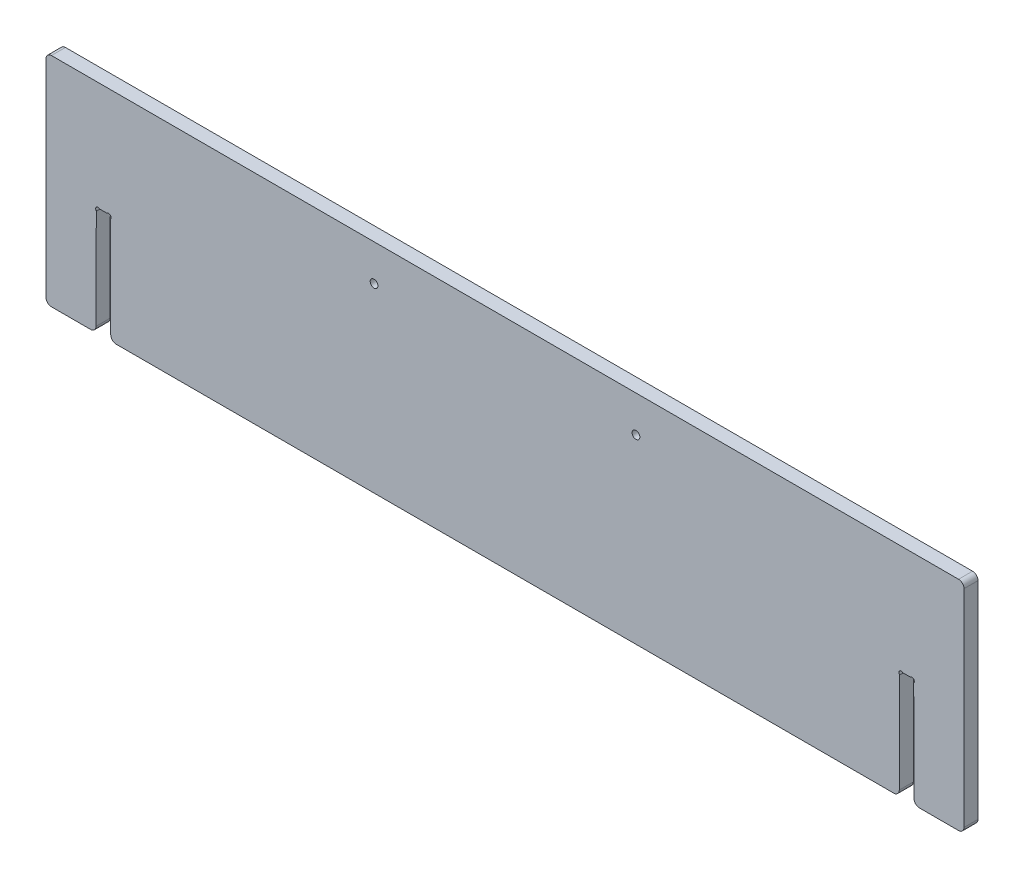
ISO-10303-21;
HEADER;
FILE_DESCRIPTION(('STEP AP214'),'2;1');
FILE_NAME('part.step','',(''),(''),'','','');
FILE_SCHEMA(('AUTOMOTIVE_DESIGN { 1 0 10303 214 1 1 1 1 }'));
ENDSEC;
DATA;
#1=APPLICATION_CONTEXT('core data for automotive mechanical design processes');
#2=APPLICATION_PROTOCOL_DEFINITION('international standard','automotive_design',2000,#1);
#3=PRODUCT_CONTEXT('',#1,'mechanical');
#4=PRODUCT('Part','Part','',(#3));
#5=PRODUCT_RELATED_PRODUCT_CATEGORY('part','',(#4));
#6=PRODUCT_DEFINITION_FORMATION('','',#4);
#7=PRODUCT_DEFINITION_CONTEXT('part definition',#1,'design');
#8=PRODUCT_DEFINITION('design','',#6,#7);
#9=PRODUCT_DEFINITION_SHAPE('','',#8);
#10=(LENGTH_UNIT() NAMED_UNIT(*) SI_UNIT(.MILLI.,.METRE.));
#11=(NAMED_UNIT(*) PLANE_ANGLE_UNIT() SI_UNIT($,.RADIAN.));
#12=(NAMED_UNIT(*) SI_UNIT($,.STERADIAN.) SOLID_ANGLE_UNIT());
#13=UNCERTAINTY_MEASURE_WITH_UNIT(LENGTH_MEASURE(1.E-05),#10,'distance_accuracy_value','');
#14=(GEOMETRIC_REPRESENTATION_CONTEXT(3) GLOBAL_UNCERTAINTY_ASSIGNED_CONTEXT((#13)) GLOBAL_UNIT_ASSIGNED_CONTEXT((#10,
#11,#12)) REPRESENTATION_CONTEXT('',''));
#15=CARTESIAN_POINT('',(0.,0.,0.));
#16=DIRECTION('',(0.,0.,1.));
#17=DIRECTION('',(1.,0.,0.));
#18=AXIS2_PLACEMENT_3D('',#15,#16,#17);
#19=CARTESIAN_POINT('',(0.,0.,18.));
#20=DIRECTION('',(0.,1.,0.));
#21=DIRECTION('',(0.,0.,1.));
#22=AXIS2_PLACEMENT_3D('',#19,#20,#21);
#23=PLANE('',#22);
#24=DIRECTION('',(1.,0.,0.));
#25=VECTOR('',#24,1.);
#26=CARTESIAN_POINT('',(0.,0.,0.));
#27=LINE('',#26,#25);
#28=CARTESIAN_POINT('',(7.,0.,0.));
#29=VERTEX_POINT('',#28);
#30=CARTESIAN_POINT('',(57.3324714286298,0.,0.));
#31=VERTEX_POINT('',#30);
#32=EDGE_CURVE('E466',#29,#31,#27,.T.);
#33=ORIENTED_EDGE('',*,*,#32,.T.);
#34=DIRECTION('',(0.,0.,1.));
#35=VECTOR('',#34,1.);
#36=CARTESIAN_POINT('',(57.3324714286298,0.,18.));
#37=LINE('',#36,#35);
#38=CARTESIAN_POINT('',(57.3324714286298,0.,18.));
#39=VERTEX_POINT('',#38);
#40=EDGE_CURVE('E491',#31,#39,#37,.T.);
#41=ORIENTED_EDGE('',*,*,#40,.T.);
#42=DIRECTION('',(1.,0.,0.));
#43=VECTOR('',#42,1.);
#44=CARTESIAN_POINT('',(0.,0.,18.));
#45=LINE('',#44,#43);
#46=CARTESIAN_POINT('',(7.,0.,18.));
#47=VERTEX_POINT('',#46);
#48=EDGE_CURVE('E459',#47,#39,#45,.T.);
#49=ORIENTED_EDGE('',*,*,#48,.F.);
#50=DIRECTION('',(0.,0.,-1.));
#51=VECTOR('',#50,1.);
#52=CARTESIAN_POINT('',(7.,0.,18.));
#53=LINE('',#52,#51);
#54=EDGE_CURVE('E488',#47,#29,#53,.T.);
#55=ORIENTED_EDGE('',*,*,#54,.T.);
#56=EDGE_LOOP('',(#33,#41,#49,#55));
#57=FACE_BOUND('',#56,.T.);
#58=ADVANCED_FACE('F33',(#57),#23,.F.);
#59=CARTESIAN_POINT('',(0.,0.,18.));
#60=DIRECTION('',(1.,0.,0.));
#61=DIRECTION('',(0.,0.,-1.));
#62=AXIS2_PLACEMENT_3D('',#59,#60,#61);
#63=PLANE('',#62);
#64=DIRECTION('',(0.,-1.,0.));
#65=VECTOR('',#64,1.);
#66=CARTESIAN_POINT('',(0.,0.,0.));
#67=LINE('',#66,#65);
#68=CARTESIAN_POINT('',(0.,273.,0.));
#69=VERTEX_POINT('',#68);
#70=CARTESIAN_POINT('',(0.,7.,0.));
#71=VERTEX_POINT('',#70);
#72=EDGE_CURVE('E438',#69,#71,#67,.T.);
#73=ORIENTED_EDGE('',*,*,#72,.T.);
#74=DIRECTION('',(0.,0.,-1.));
#75=VECTOR('',#74,1.);
#76=CARTESIAN_POINT('',(0.,7.,18.));
#77=LINE('',#76,#75);
#78=CARTESIAN_POINT('',(0.,7.,18.));
#79=VERTEX_POINT('',#78);
#80=EDGE_CURVE('E41',#71,#79,#77,.F.);
#81=ORIENTED_EDGE('',*,*,#80,.T.);
#82=DIRECTION('',(0.,-1.,0.));
#83=VECTOR('',#82,1.);
#84=CARTESIAN_POINT('',(0.,0.,18.));
#85=LINE('',#84,#83);
#86=CARTESIAN_POINT('',(0.,273.,18.));
#87=VERTEX_POINT('',#86);
#88=EDGE_CURVE('E453',#87,#79,#85,.T.);
#89=ORIENTED_EDGE('',*,*,#88,.F.);
#90=DIRECTION('',(0.,0.,-1.));
#91=VECTOR('',#90,1.);
#92=CARTESIAN_POINT('',(0.,273.,18.));
#93=LINE('',#92,#91);
#94=EDGE_CURVE('E496',#87,#69,#93,.T.);
#95=ORIENTED_EDGE('',*,*,#94,.T.);
#96=EDGE_LOOP('',(#73,#81,#89,#95));
#97=FACE_BOUND('',#96,.T.);
#98=ADVANCED_FACE('F501',(#97),#63,.F.);
#99=CARTESIAN_POINT('',(90.2925285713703,0.,18.));
#100=VERTEX_POINT('',#99);
#101=CARTESIAN_POINT('',(1090.70747142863,0.,18.));
#102=VERTEX_POINT('',#101);
#103=EDGE_CURVE('E456',#100,#102,#45,.T.);
#104=ORIENTED_EDGE('',*,*,#103,.F.);
#105=DIRECTION('',(0.,0.,1.));
#106=VECTOR('',#105,1.);
#107=CARTESIAN_POINT('',(90.2925285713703,0.,18.));
#108=LINE('',#107,#106);
#109=CARTESIAN_POINT('',(90.2925285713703,0.,0.));
#110=VERTEX_POINT('',#109);
#111=EDGE_CURVE('E480',#100,#110,#108,.F.);
#112=ORIENTED_EDGE('',*,*,#111,.T.);
#113=CARTESIAN_POINT('',(1090.70747142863,0.,0.));
#114=VERTEX_POINT('',#113);
#115=EDGE_CURVE('E465',#110,#114,#27,.T.);
#116=ORIENTED_EDGE('',*,*,#115,.T.);
#117=DIRECTION('',(0.,0.,1.));
#118=VECTOR('',#117,1.);
#119=CARTESIAN_POINT('',(1090.70747142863,0.,18.));
#120=LINE('',#119,#118);
#121=EDGE_CURVE('E347',#102,#114,#120,.F.);
#122=ORIENTED_EDGE('',*,*,#121,.F.);
#123=EDGE_LOOP('',(#104,#112,#116,#122));
#124=FACE_BOUND('',#123,.T.);
#125=ADVANCED_FACE('F563',(#124),#23,.F.);
#126=CARTESIAN_POINT('',(0.,280.,18.));
#127=DIRECTION('',(0.,-1.,0.));
#128=DIRECTION('',(0.,0.,-1.));
#129=AXIS2_PLACEMENT_3D('',#126,#127,#128);
#130=PLANE('',#129);
#131=DIRECTION('',(-1.,0.,0.));
#132=VECTOR('',#131,1.);
#133=CARTESIAN_POINT('',(0.,280.,0.));
#134=LINE('',#133,#132);
#135=CARTESIAN_POINT('',(1174.,280.,0.));
#136=VERTEX_POINT('',#135);
#137=CARTESIAN_POINT('',(7.,280.,0.));
#138=VERTEX_POINT('',#137);
#139=EDGE_CURVE('E457',#136,#138,#134,.T.);
#140=ORIENTED_EDGE('',*,*,#139,.T.);
#141=DIRECTION('',(0.,0.,-1.));
#142=VECTOR('',#141,1.);
#143=CARTESIAN_POINT('',(7.,280.,18.));
#144=LINE('',#143,#142);
#145=CARTESIAN_POINT('',(7.,280.,18.));
#146=VERTEX_POINT('',#145);
#147=EDGE_CURVE('E11',#138,#146,#144,.F.);
#148=ORIENTED_EDGE('',*,*,#147,.T.);
#149=DIRECTION('',(-1.,0.,0.));
#150=VECTOR('',#149,1.);
#151=CARTESIAN_POINT('',(0.,280.,18.));
#152=LINE('',#151,#150);
#153=CARTESIAN_POINT('',(1174.,280.,18.));
#154=VERTEX_POINT('',#153);
#155=EDGE_CURVE('E460',#154,#146,#152,.T.);
#156=ORIENTED_EDGE('',*,*,#155,.F.);
#157=DIRECTION('',(0.,0.,-1.));
#158=VECTOR('',#157,1.);
#159=CARTESIAN_POINT('',(1174.,280.,18.));
#160=LINE('',#159,#158);
#161=EDGE_CURVE('E374',#136,#154,#160,.F.);
#162=ORIENTED_EDGE('',*,*,#161,.F.);
#163=EDGE_LOOP('',(#140,#148,#156,#162));
#164=FACE_BOUND('',#163,.T.);
#165=ADVANCED_FACE('F616',(#164),#130,.F.);
#166=CARTESIAN_POINT('',(0.,0.,18.));
#167=DIRECTION('',(0.,0.,-1.));
#168=DIRECTION('',(-1.,0.,0.));
#169=AXIS2_PLACEMENT_3D('',#166,#167,#168);
#170=PLANE('',#169);
#171=CARTESIAN_POINT('',(422.0625,233.333333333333,18.));
#172=DIRECTION('',(0.,0.,1.));
#173=DIRECTION('',(1.,0.,0.));
#174=AXIS2_PLACEMENT_3D('',#171,#172,#173);
#175=CIRCLE('',#174,4.99999999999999);
#176=CARTESIAN_POINT('',(427.0625,233.333333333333,18.));
#177=VERTEX_POINT('',#176);
#178=EDGE_CURVE('E377',#177,#177,#175,.T.);
#179=ORIENTED_EDGE('',*,*,#178,.F.);
#180=EDGE_LOOP('',(#179));
#181=FACE_BOUND('',#180,.T.);
#182=DIRECTION('',(-0.00285713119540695,0.999995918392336,0.));
#183=VECTOR('',#182,1.);
#184=CARTESIAN_POINT('',(82.9260745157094,135.248919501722,18.));
#185=LINE('',#184,#183);
#186=CARTESIAN_POINT('',(83.2925571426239,6.9800000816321,18.));
#187=VERTEX_POINT('',#186);
#188=CARTESIAN_POINT('',(82.9260745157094,135.248919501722,18.));
#189=VERTEX_POINT('',#188);
#190=EDGE_CURVE('E381',#187,#189,#185,.T.);
#191=ORIENTED_EDGE('',*,*,#190,.F.);
#192=CARTESIAN_POINT('',(90.2925285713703,7.00000000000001,18.));
#193=DIRECTION('',(0.,0.,-1.));
#194=DIRECTION('',(-1.,0.,0.));
#195=AXIS2_PLACEMENT_3D('',#192,#193,#194);
#196=CIRCLE('',#195,7.);
#197=EDGE_CURVE('E478',#187,#100,#196,.F.);
#198=ORIENTED_EDGE('',*,*,#197,.T.);
#199=ORIENTED_EDGE('',*,*,#103,.T.);
#200=CARTESIAN_POINT('',(1090.70747142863,7.00000000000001,18.));
#201=DIRECTION('',(0.,0.,1.));
#202=DIRECTION('',(1.,0.,0.));
#203=AXIS2_PLACEMENT_3D('',#200,#201,#202);
#204=CIRCLE('',#203,7.);
#205=CARTESIAN_POINT('',(1097.70744285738,6.9800000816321,18.));
#206=VERTEX_POINT('',#205);
#207=EDGE_CURVE('E344',#206,#102,#204,.F.);
#208=ORIENTED_EDGE('',*,*,#207,.F.);
#209=DIRECTION('',(0.00285713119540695,0.999995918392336,0.));
#210=VECTOR('',#209,1.);
#211=CARTESIAN_POINT('',(1098.07392548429,135.248919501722,18.));
#212=LINE('',#211,#210);
#213=CARTESIAN_POINT('',(1098.07392548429,135.248919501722,18.));
#214=VERTEX_POINT('',#213);
#215=EDGE_CURVE('E286',#206,#214,#212,.T.);
#216=ORIENTED_EDGE('',*,*,#215,.T.);
#217=CARTESIAN_POINT('',(1097.0739295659,135.251776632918,18.));
#218=DIRECTION('',(0.,0.,1.));
#219=DIRECTION('',(-1.,0.,0.));
#220=AXIS2_PLACEMENT_3D('',#217,#218,#219);
#221=CIRCLE('',#220,1.);
#222=CARTESIAN_POINT('',(1097.8557835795,135.875238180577,18.));
#223=VERTEX_POINT('',#222);
#224=EDGE_CURVE('E289',#214,#223,#221,.T.);
#225=ORIENTED_EDGE('',*,*,#224,.T.);
#226=CARTESIAN_POINT('',(1100.27953102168,137.807968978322,18.));
#227=DIRECTION('',(0.,0.,-1.));
#228=DIRECTION('',(1.,0.,0.));
#229=AXIS2_PLACEMENT_3D('',#226,#227,#228);
#230=CIRCLE('',#229,3.1);
#231=CARTESIAN_POINT('',(1102.22505951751,140.221455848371,18.));
#232=VERTEX_POINT('',#231);
#233=EDGE_CURVE('E247',#223,#232,#230,.T.);
#234=ORIENTED_EDGE('',*,*,#233,.T.);
#235=CARTESIAN_POINT('',(1102.85264935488,141.,18.));
#236=DIRECTION('',(0.,0.,1.));
#237=DIRECTION('',(1.,0.,0.));
#238=AXIS2_PLACEMENT_3D('',#235,#236,#237);
#239=CIRCLE('',#238,0.999999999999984);
#240=CARTESIAN_POINT('',(1102.85264935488,140.,18.));
#241=VERTEX_POINT('',#240);
#242=EDGE_CURVE('E293',#232,#241,#239,.T.);
#243=ORIENTED_EDGE('',*,*,#242,.T.);
#244=DIRECTION('',(1.,0.,0.));
#245=VECTOR('',#244,1.);
#246=CARTESIAN_POINT('',(1111.52235064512,140.,18.));
#247=LINE('',#246,#245);
#248=CARTESIAN_POINT('',(1111.52235064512,140.,18.));
#249=VERTEX_POINT('',#248);
#250=EDGE_CURVE('E296',#241,#249,#247,.T.);
#251=ORIENTED_EDGE('',*,*,#250,.T.);
#252=CARTESIAN_POINT('',(1111.52235064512,141.,18.));
#253=DIRECTION('',(0.,0.,1.));
#254=DIRECTION('',(-1.,0.,0.));
#255=AXIS2_PLACEMENT_3D('',#252,#253,#254);
#256=CIRCLE('',#255,0.999999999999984);
#257=CARTESIAN_POINT('',(1112.14994048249,140.221455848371,18.));
#258=VERTEX_POINT('',#257);
#259=EDGE_CURVE('E299',#249,#258,#256,.T.);
#260=ORIENTED_EDGE('',*,*,#259,.T.);
#261=CARTESIAN_POINT('',(1114.09546897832,137.807968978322,18.));
#262=DIRECTION('',(0.,0.,-1.));
#263=DIRECTION('',(-1.,0.,0.));
#264=AXIS2_PLACEMENT_3D('',#261,#262,#263);
#265=CIRCLE('',#264,3.1);
#266=CARTESIAN_POINT('',(1116.5192164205,135.875238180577,18.));
#267=VERTEX_POINT('',#266);
#268=EDGE_CURVE('E302',#258,#267,#265,.T.);
#269=ORIENTED_EDGE('',*,*,#268,.T.);
#270=CARTESIAN_POINT('',(1117.3010704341,135.251776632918,18.));
#271=DIRECTION('',(0.,0.,1.));
#272=DIRECTION('',(1.,0.,0.));
#273=AXIS2_PLACEMENT_3D('',#270,#271,#272);
#274=CIRCLE('',#273,1.);
#275=CARTESIAN_POINT('',(1116.30107451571,135.248919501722,18.));
#276=VERTEX_POINT('',#275);
#277=EDGE_CURVE('E305',#267,#276,#274,.T.);
#278=ORIENTED_EDGE('',*,*,#277,.T.);
#279=DIRECTION('',(0.00285713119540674,-0.999995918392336,0.));
#280=VECTOR('',#279,1.);
#281=CARTESIAN_POINT('',(1116.30107451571,135.248919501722,18.));
#282=LINE('',#281,#280);
#283=CARTESIAN_POINT('',(1116.66755714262,6.9800000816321,18.));
#284=VERTEX_POINT('',#283);
#285=EDGE_CURVE('E308',#276,#284,#282,.T.);
#286=ORIENTED_EDGE('',*,*,#285,.T.);
#287=CARTESIAN_POINT('',(1123.66752857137,7.,18.));
#288=DIRECTION('',(0.,0.,1.));
#289=DIRECTION('',(1.,0.,0.));
#290=AXIS2_PLACEMENT_3D('',#287,#288,#289);
#291=CIRCLE('',#290,7.);
#292=CARTESIAN_POINT('',(1123.66752857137,0.,18.));
#293=VERTEX_POINT('',#292);
#294=EDGE_CURVE('E341',#293,#284,#291,.F.);
#295=ORIENTED_EDGE('',*,*,#294,.F.);
#296=DIRECTION('',(-1.,0.,0.));
#297=VECTOR('',#296,1.);
#298=CARTESIAN_POINT('',(1181.,0.,18.));
#299=LINE('',#298,#297);
#300=CARTESIAN_POINT('',(1174.,0.,18.));
#301=VERTEX_POINT('',#300);
#302=EDGE_CURVE('E327',#301,#293,#299,.T.);
#303=ORIENTED_EDGE('',*,*,#302,.F.);
#304=CARTESIAN_POINT('',(1174.,7.,18.));
#305=DIRECTION('',(0.,0.,1.));
#306=DIRECTION('',(1.,0.,0.));
#307=AXIS2_PLACEMENT_3D('',#304,#305,#306);
#308=CIRCLE('',#307,7.);
#309=CARTESIAN_POINT('',(1181.,7.,18.));
#310=VERTEX_POINT('',#309);
#311=EDGE_CURVE('E339',#310,#301,#308,.F.);
#312=ORIENTED_EDGE('',*,*,#311,.F.);
#313=DIRECTION('',(0.,-1.,0.));
#314=VECTOR('',#313,1.);
#315=CARTESIAN_POINT('',(1181.,0.,18.));
#316=LINE('',#315,#314);
#317=CARTESIAN_POINT('',(1181.,273.,18.));
#318=VERTEX_POINT('',#317);
#319=EDGE_CURVE('E324',#318,#310,#316,.T.);
#320=ORIENTED_EDGE('',*,*,#319,.F.);
#321=CARTESIAN_POINT('',(1174.,273.,18.));
#322=DIRECTION('',(0.,0.,1.));
#323=DIRECTION('',(1.,0.,0.));
#324=AXIS2_PLACEMENT_3D('',#321,#322,#323);
#325=CIRCLE('',#324,7.);
#326=EDGE_CURVE('E337',#154,#318,#325,.F.);
#327=ORIENTED_EDGE('',*,*,#326,.F.);
#328=ORIENTED_EDGE('',*,*,#155,.T.);
#329=CARTESIAN_POINT('',(7.,273.,18.));
#330=DIRECTION('',(0.,0.,-1.));
#331=DIRECTION('',(-1.,0.,0.));
#332=AXIS2_PLACEMENT_3D('',#329,#330,#331);
#333=CIRCLE('',#332,7.);
#334=EDGE_CURVE('E472',#146,#87,#333,.F.);
#335=ORIENTED_EDGE('',*,*,#334,.T.);
#336=ORIENTED_EDGE('',*,*,#88,.T.);
#337=CARTESIAN_POINT('',(7.,7.,18.));
#338=DIRECTION('',(0.,0.,-1.));
#339=DIRECTION('',(-1.,0.,0.));
#340=AXIS2_PLACEMENT_3D('',#337,#338,#339);
#341=CIRCLE('',#340,7.);
#342=EDGE_CURVE('E474',#79,#47,#341,.F.);
#343=ORIENTED_EDGE('',*,*,#342,.T.);
#344=ORIENTED_EDGE('',*,*,#48,.T.);
#345=CARTESIAN_POINT('',(57.3324714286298,7.,18.));
#346=DIRECTION('',(0.,0.,-1.));
#347=DIRECTION('',(-1.,0.,0.));
#348=AXIS2_PLACEMENT_3D('',#345,#346,#347);
#349=CIRCLE('',#348,7.);
#350=CARTESIAN_POINT('',(64.3324428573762,6.9800000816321,18.));
#351=VERTEX_POINT('',#350);
#352=EDGE_CURVE('E476',#39,#351,#349,.F.);
#353=ORIENTED_EDGE('',*,*,#352,.T.);
#354=DIRECTION('',(-0.00285713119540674,-0.999995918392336,0.));
#355=VECTOR('',#354,1.);
#356=CARTESIAN_POINT('',(64.6989254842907,135.248919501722,18.));
#357=LINE('',#356,#355);
#358=CARTESIAN_POINT('',(64.6989254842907,135.248919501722,18.));
#359=VERTEX_POINT('',#358);
#360=EDGE_CURVE('E387',#359,#351,#357,.T.);
#361=ORIENTED_EDGE('',*,*,#360,.F.);
#362=CARTESIAN_POINT('',(63.6989295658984,135.251776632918,18.));
#363=DIRECTION('',(0.,0.,-1.));
#364=DIRECTION('',(-1.,0.,0.));
#365=AXIS2_PLACEMENT_3D('',#362,#363,#364);
#366=CIRCLE('',#365,1.);
#367=CARTESIAN_POINT('',(64.4807835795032,135.875238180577,18.));
#368=VERTEX_POINT('',#367);
#369=EDGE_CURVE('E431',#368,#359,#366,.T.);
#370=ORIENTED_EDGE('',*,*,#369,.F.);
#371=CARTESIAN_POINT('',(66.9045310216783,137.807968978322,18.));
#372=DIRECTION('',(0.,0.,1.));
#373=DIRECTION('',(1.,0.,0.));
#374=AXIS2_PLACEMENT_3D('',#371,#372,#373);
#375=CIRCLE('',#374,3.1);
#376=CARTESIAN_POINT('',(68.8500595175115,140.221455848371,18.));
#377=VERTEX_POINT('',#376);
#378=EDGE_CURVE('E428',#377,#368,#375,.T.);
#379=ORIENTED_EDGE('',*,*,#378,.F.);
#380=CARTESIAN_POINT('',(69.4776493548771,141.,18.));
#381=DIRECTION('',(0.,0.,-1.));
#382=DIRECTION('',(1.,0.,0.));
#383=AXIS2_PLACEMENT_3D('',#380,#381,#382);
#384=CIRCLE('',#383,0.999999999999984);
#385=CARTESIAN_POINT('',(69.4776493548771,140.,18.));
#386=VERTEX_POINT('',#385);
#387=EDGE_CURVE('E425',#386,#377,#384,.T.);
#388=ORIENTED_EDGE('',*,*,#387,.F.);
#389=DIRECTION('',(-1.,0.,0.));
#390=VECTOR('',#389,1.);
#391=CARTESIAN_POINT('',(69.4776493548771,140.,18.));
#392=LINE('',#391,#390);
#393=CARTESIAN_POINT('',(78.147350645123,140.,18.));
#394=VERTEX_POINT('',#393);
#395=EDGE_CURVE('E422',#394,#386,#392,.T.);
#396=ORIENTED_EDGE('',*,*,#395,.F.);
#397=CARTESIAN_POINT('',(78.147350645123,141.,18.));
#398=DIRECTION('',(0.,0.,-1.));
#399=DIRECTION('',(-1.,0.,0.));
#400=AXIS2_PLACEMENT_3D('',#397,#398,#399);
#401=CIRCLE('',#400,0.999999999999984);
#402=CARTESIAN_POINT('',(78.7749404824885,140.221455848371,18.));
#403=VERTEX_POINT('',#402);
#404=EDGE_CURVE('E419',#403,#394,#401,.T.);
#405=ORIENTED_EDGE('',*,*,#404,.F.);
#406=CARTESIAN_POINT('',(80.7204689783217,137.807968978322,18.));
#407=DIRECTION('',(0.,0.,1.));
#408=DIRECTION('',(-1.,0.,0.));
#409=AXIS2_PLACEMENT_3D('',#406,#407,#408);
#410=CIRCLE('',#409,3.1);
#411=CARTESIAN_POINT('',(83.1442164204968,135.875238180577,18.));
#412=VERTEX_POINT('',#411);
#413=EDGE_CURVE('E416',#412,#403,#410,.T.);
#414=ORIENTED_EDGE('',*,*,#413,.F.);
#415=CARTESIAN_POINT('',(83.9260704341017,135.251776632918,18.));
#416=DIRECTION('',(0.,0.,-1.));
#417=DIRECTION('',(1.,0.,0.));
#418=AXIS2_PLACEMENT_3D('',#415,#416,#417);
#419=CIRCLE('',#418,1.);
#420=EDGE_CURVE('E413',#189,#412,#419,.T.);
#421=ORIENTED_EDGE('',*,*,#420,.F.);
#422=EDGE_LOOP('',(#191,#198,#199,#208,#216,#225,#234,#243,#251,#260,#269,#278,#286,#295,#303,
#312,#320,#327,#328,#335,#336,#343,#344,#353,#361,#370,#379,#388,#396,#405,#414,#421));
#423=FACE_BOUND('',#422,.T.);
#424=CARTESIAN_POINT('',(758.9375,233.333333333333,18.));
#425=DIRECTION('',(0.,0.,-1.));
#426=DIRECTION('',(-1.,0.,0.));
#427=AXIS2_PLACEMENT_3D('',#424,#425,#426);
#428=CIRCLE('',#427,4.99999999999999);
#429=CARTESIAN_POINT('',(753.9375,233.333333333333,18.));
#430=VERTEX_POINT('',#429);
#431=EDGE_CURVE('E705',#430,#430,#428,.T.);
#432=ORIENTED_EDGE('',*,*,#431,.T.);
#433=EDGE_LOOP('',(#432));
#434=FACE_BOUND('',#433,.T.);
#435=ADVANCED_FACE('F507',(#181,#423,#434),#170,.F.);
#436=CARTESIAN_POINT('',(0.,0.,0.));
#437=DIRECTION('',(0.,0.,-1.));
#438=DIRECTION('',(-1.,0.,0.));
#439=AXIS2_PLACEMENT_3D('',#436,#437,#438);
#440=PLANE('',#439);
#441=CARTESIAN_POINT('',(422.0625,233.333333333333,0.));
#442=DIRECTION('',(0.,0.,1.));
#443=DIRECTION('',(1.,0.,0.));
#444=AXIS2_PLACEMENT_3D('',#441,#442,#443);
#445=CIRCLE('',#444,4.99999999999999);
#446=CARTESIAN_POINT('',(427.0625,233.333333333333,0.));
#447=VERTEX_POINT('',#446);
#448=EDGE_CURVE('E378',#447,#447,#445,.T.);
#449=ORIENTED_EDGE('',*,*,#448,.T.);
#450=EDGE_LOOP('',(#449));
#451=FACE_BOUND('',#450,.T.);
#452=ORIENTED_EDGE('',*,*,#115,.F.);
#453=CARTESIAN_POINT('',(90.2925285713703,7.00000000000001,0.));
#454=DIRECTION('',(0.,0.,-1.));
#455=DIRECTION('',(-1.,0.,0.));
#456=AXIS2_PLACEMENT_3D('',#453,#454,#455);
#457=CIRCLE('',#456,7.);
#458=CARTESIAN_POINT('',(83.2925571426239,6.9800000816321,0.));
#459=VERTEX_POINT('',#458);
#460=EDGE_CURVE('E486',#110,#459,#457,.T.);
#461=ORIENTED_EDGE('',*,*,#460,.T.);
#462=DIRECTION('',(-0.00285713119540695,0.999995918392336,0.));
#463=VECTOR('',#462,1.);
#464=CARTESIAN_POINT('',(82.9260745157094,135.248919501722,0.));
#465=LINE('',#464,#463);
#466=CARTESIAN_POINT('',(82.9260745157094,135.248919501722,0.));
#467=VERTEX_POINT('',#466);
#468=EDGE_CURVE('E384',#459,#467,#465,.T.);
#469=ORIENTED_EDGE('',*,*,#468,.T.);
#470=CARTESIAN_POINT('',(83.9260704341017,135.251776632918,0.));
#471=DIRECTION('',(0.,0.,-1.));
#472=DIRECTION('',(1.,0.,0.));
#473=AXIS2_PLACEMENT_3D('',#470,#471,#472);
#474=CIRCLE('',#473,1.);
#475=CARTESIAN_POINT('',(83.1442164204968,135.875238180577,0.));
#476=VERTEX_POINT('',#475);
#477=EDGE_CURVE('E386',#467,#476,#474,.T.);
#478=ORIENTED_EDGE('',*,*,#477,.T.);
#479=CARTESIAN_POINT('',(80.7204689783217,137.807968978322,0.));
#480=DIRECTION('',(0.,0.,1.));
#481=DIRECTION('',(-1.,0.,0.));
#482=AXIS2_PLACEMENT_3D('',#479,#480,#481);
#483=CIRCLE('',#482,3.1);
#484=CARTESIAN_POINT('',(78.7749404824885,140.221455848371,0.));
#485=VERTEX_POINT('',#484);
#486=EDGE_CURVE('E390',#476,#485,#483,.T.);
#487=ORIENTED_EDGE('',*,*,#486,.T.);
#488=CARTESIAN_POINT('',(78.147350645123,141.,0.));
#489=DIRECTION('',(0.,0.,-1.));
#490=DIRECTION('',(-1.,0.,0.));
#491=AXIS2_PLACEMENT_3D('',#488,#489,#490);
#492=CIRCLE('',#491,0.999999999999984);
#493=CARTESIAN_POINT('',(78.147350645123,140.,0.));
#494=VERTEX_POINT('',#493);
#495=EDGE_CURVE('E393',#485,#494,#492,.T.);
#496=ORIENTED_EDGE('',*,*,#495,.T.);
#497=DIRECTION('',(-1.,0.,0.));
#498=VECTOR('',#497,1.);
#499=CARTESIAN_POINT('',(69.4776493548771,140.,0.));
#500=LINE('',#499,#498);
#501=CARTESIAN_POINT('',(69.4776493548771,140.,0.));
#502=VERTEX_POINT('',#501);
#503=EDGE_CURVE('E396',#494,#502,#500,.T.);
#504=ORIENTED_EDGE('',*,*,#503,.T.);
#505=CARTESIAN_POINT('',(69.4776493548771,141.,0.));
#506=DIRECTION('',(0.,0.,-1.));
#507=DIRECTION('',(1.,0.,0.));
#508=AXIS2_PLACEMENT_3D('',#505,#506,#507);
#509=CIRCLE('',#508,0.999999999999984);
#510=CARTESIAN_POINT('',(68.8500595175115,140.221455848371,0.));
#511=VERTEX_POINT('',#510);
#512=EDGE_CURVE('E399',#502,#511,#509,.T.);
#513=ORIENTED_EDGE('',*,*,#512,.T.);
#514=CARTESIAN_POINT('',(66.9045310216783,137.807968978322,0.));
#515=DIRECTION('',(0.,0.,1.));
#516=DIRECTION('',(1.,0.,0.));
#517=AXIS2_PLACEMENT_3D('',#514,#515,#516);
#518=CIRCLE('',#517,3.1);
#519=CARTESIAN_POINT('',(64.4807835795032,135.875238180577,0.));
#520=VERTEX_POINT('',#519);
#521=EDGE_CURVE('E402',#511,#520,#518,.T.);
#522=ORIENTED_EDGE('',*,*,#521,.T.);
#523=CARTESIAN_POINT('',(63.6989295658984,135.251776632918,0.));
#524=DIRECTION('',(0.,0.,-1.));
#525=DIRECTION('',(-1.,0.,0.));
#526=AXIS2_PLACEMENT_3D('',#523,#524,#525);
#527=CIRCLE('',#526,1.);
#528=CARTESIAN_POINT('',(64.6989254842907,135.248919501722,0.));
#529=VERTEX_POINT('',#528);
#530=EDGE_CURVE('E405',#520,#529,#527,.T.);
#531=ORIENTED_EDGE('',*,*,#530,.T.);
#532=DIRECTION('',(-0.00285713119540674,-0.999995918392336,0.));
#533=VECTOR('',#532,1.);
#534=CARTESIAN_POINT('',(64.6989254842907,135.248919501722,0.));
#535=LINE('',#534,#533);
#536=CARTESIAN_POINT('',(64.3324428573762,6.9800000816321,0.));
#537=VERTEX_POINT('',#536);
#538=EDGE_CURVE('E408',#529,#537,#535,.T.);
#539=ORIENTED_EDGE('',*,*,#538,.T.);
#540=CARTESIAN_POINT('',(57.3324714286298,7.,0.));
#541=DIRECTION('',(0.,0.,-1.));
#542=DIRECTION('',(-1.,0.,0.));
#543=AXIS2_PLACEMENT_3D('',#540,#541,#542);
#544=CIRCLE('',#543,7.);
#545=EDGE_CURVE('E484',#537,#31,#544,.T.);
#546=ORIENTED_EDGE('',*,*,#545,.T.);
#547=ORIENTED_EDGE('',*,*,#32,.F.);
#548=CARTESIAN_POINT('',(7.,7.,0.));
#549=DIRECTION('',(0.,0.,-1.));
#550=DIRECTION('',(-1.,0.,0.));
#551=AXIS2_PLACEMENT_3D('',#548,#549,#550);
#552=CIRCLE('',#551,7.);
#553=EDGE_CURVE('E54',#29,#71,#552,.T.);
#554=ORIENTED_EDGE('',*,*,#553,.T.);
#555=ORIENTED_EDGE('',*,*,#72,.F.);
#556=CARTESIAN_POINT('',(7.,273.,0.));
#557=DIRECTION('',(0.,0.,-1.));
#558=DIRECTION('',(-1.,0.,0.));
#559=AXIS2_PLACEMENT_3D('',#556,#557,#558);
#560=CIRCLE('',#559,7.);
#561=EDGE_CURVE('E48',#69,#138,#560,.T.);
#562=ORIENTED_EDGE('',*,*,#561,.T.);
#563=ORIENTED_EDGE('',*,*,#139,.F.);
#564=CARTESIAN_POINT('',(1174.,273.,0.));
#565=DIRECTION('',(0.,0.,1.));
#566=DIRECTION('',(1.,0.,0.));
#567=AXIS2_PLACEMENT_3D('',#564,#565,#566);
#568=CIRCLE('',#567,7.);
#569=CARTESIAN_POINT('',(1181.,273.,0.));
#570=VERTEX_POINT('',#569);
#571=EDGE_CURVE('E350',#570,#136,#568,.T.);
#572=ORIENTED_EDGE('',*,*,#571,.F.);
#573=DIRECTION('',(0.,-1.,0.));
#574=VECTOR('',#573,1.);
#575=CARTESIAN_POINT('',(1181.,0.,0.));
#576=LINE('',#575,#574);
#577=CARTESIAN_POINT('',(1181.,7.,0.));
#578=VERTEX_POINT('',#577);
#579=EDGE_CURVE('E313',#570,#578,#576,.T.);
#580=ORIENTED_EDGE('',*,*,#579,.T.);
#581=CARTESIAN_POINT('',(1174.,7.,0.));
#582=DIRECTION('',(0.,0.,1.));
#583=DIRECTION('',(1.,0.,0.));
#584=AXIS2_PLACEMENT_3D('',#581,#582,#583);
#585=CIRCLE('',#584,7.);
#586=CARTESIAN_POINT('',(1174.,0.,0.));
#587=VERTEX_POINT('',#586);
#588=EDGE_CURVE('E353',#587,#578,#585,.T.);
#589=ORIENTED_EDGE('',*,*,#588,.F.);
#590=DIRECTION('',(-1.,0.,0.));
#591=VECTOR('',#590,1.);
#592=CARTESIAN_POINT('',(1181.,0.,0.));
#593=LINE('',#592,#591);
#594=CARTESIAN_POINT('',(1123.66752857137,0.,0.));
#595=VERTEX_POINT('',#594);
#596=EDGE_CURVE('E328',#587,#595,#593,.T.);
#597=ORIENTED_EDGE('',*,*,#596,.T.);
#598=CARTESIAN_POINT('',(1123.66752857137,7.,0.));
#599=DIRECTION('',(0.,0.,1.));
#600=DIRECTION('',(1.,0.,0.));
#601=AXIS2_PLACEMENT_3D('',#598,#599,#600);
#602=CIRCLE('',#601,7.);
#603=CARTESIAN_POINT('',(1116.66755714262,6.9800000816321,0.));
#604=VERTEX_POINT('',#603);
#605=EDGE_CURVE('E355',#604,#595,#602,.T.);
#606=ORIENTED_EDGE('',*,*,#605,.F.);
#607=DIRECTION('',(0.00285713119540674,-0.999995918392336,0.));
#608=VECTOR('',#607,1.);
#609=CARTESIAN_POINT('',(1116.30107451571,135.248919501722,0.));
#610=LINE('',#609,#608);
#611=CARTESIAN_POINT('',(1116.30107451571,135.248919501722,0.));
#612=VERTEX_POINT('',#611);
#613=EDGE_CURVE('E283',#612,#604,#610,.T.);
#614=ORIENTED_EDGE('',*,*,#613,.F.);
#615=CARTESIAN_POINT('',(1117.3010704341,135.251776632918,0.));
#616=DIRECTION('',(0.,0.,1.));
#617=DIRECTION('',(1.,0.,0.));
#618=AXIS2_PLACEMENT_3D('',#615,#616,#617);
#619=CIRCLE('',#618,1.);
#620=CARTESIAN_POINT('',(1116.5192164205,135.875238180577,0.));
#621=VERTEX_POINT('',#620);
#622=EDGE_CURVE('E280',#621,#612,#619,.T.);
#623=ORIENTED_EDGE('',*,*,#622,.F.);
#624=CARTESIAN_POINT('',(1114.09546897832,137.807968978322,0.));
#625=DIRECTION('',(0.,0.,-1.));
#626=DIRECTION('',(-1.,0.,0.));
#627=AXIS2_PLACEMENT_3D('',#624,#625,#626);
#628=CIRCLE('',#627,3.1);
#629=CARTESIAN_POINT('',(1112.14994048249,140.221455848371,0.));
#630=VERTEX_POINT('',#629);
#631=EDGE_CURVE('E277',#630,#621,#628,.T.);
#632=ORIENTED_EDGE('',*,*,#631,.F.);
#633=CARTESIAN_POINT('',(1111.52235064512,141.,0.));
#634=DIRECTION('',(0.,0.,1.));
#635=DIRECTION('',(-1.,0.,0.));
#636=AXIS2_PLACEMENT_3D('',#633,#634,#635);
#637=CIRCLE('',#636,0.999999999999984);
#638=CARTESIAN_POINT('',(1111.52235064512,140.,0.));
#639=VERTEX_POINT('',#638);
#640=EDGE_CURVE('E274',#639,#630,#637,.T.);
#641=ORIENTED_EDGE('',*,*,#640,.F.);
#642=DIRECTION('',(1.,0.,0.));
#643=VECTOR('',#642,1.);
#644=CARTESIAN_POINT('',(1111.52235064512,140.,0.));
#645=LINE('',#644,#643);
#646=CARTESIAN_POINT('',(1102.85264935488,140.,0.));
#647=VERTEX_POINT('',#646);
#648=EDGE_CURVE('E268',#647,#639,#645,.T.);
#649=ORIENTED_EDGE('',*,*,#648,.F.);
#650=CARTESIAN_POINT('',(1102.85264935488,141.,0.));
#651=DIRECTION('',(0.,0.,1.));
#652=DIRECTION('',(1.,0.,0.));
#653=AXIS2_PLACEMENT_3D('',#650,#651,#652);
#654=CIRCLE('',#653,0.999999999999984);
#655=CARTESIAN_POINT('',(1102.22505951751,140.221455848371,0.));
#656=VERTEX_POINT('',#655);
#657=EDGE_CURVE('E266',#656,#647,#654,.T.);
#658=ORIENTED_EDGE('',*,*,#657,.F.);
#659=CARTESIAN_POINT('',(1100.27953102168,137.807968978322,0.));
#660=DIRECTION('',(0.,0.,-1.));
#661=DIRECTION('',(1.,0.,0.));
#662=AXIS2_PLACEMENT_3D('',#659,#660,#661);
#663=CIRCLE('',#662,3.1);
#664=CARTESIAN_POINT('',(1097.8557835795,135.875238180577,0.));
#665=VERTEX_POINT('',#664);
#666=EDGE_CURVE('E244',#665,#656,#663,.T.);
#667=ORIENTED_EDGE('',*,*,#666,.F.);
#668=CARTESIAN_POINT('',(1097.0739295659,135.251776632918,0.));
#669=DIRECTION('',(0.,0.,1.));
#670=DIRECTION('',(-1.,0.,0.));
#671=AXIS2_PLACEMENT_3D('',#668,#669,#670);
#672=CIRCLE('',#671,1.);
#673=CARTESIAN_POINT('',(1098.07392548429,135.248919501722,0.));
#674=VERTEX_POINT('',#673);
#675=EDGE_CURVE('E255',#674,#665,#672,.T.);
#676=ORIENTED_EDGE('',*,*,#675,.F.);
#677=DIRECTION('',(0.00285713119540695,0.999995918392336,0.));
#678=VECTOR('',#677,1.);
#679=CARTESIAN_POINT('',(1098.07392548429,135.248919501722,0.));
#680=LINE('',#679,#678);
#681=CARTESIAN_POINT('',(1097.70744285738,6.9800000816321,0.));
#682=VERTEX_POINT('',#681);
#683=EDGE_CURVE('E259',#682,#674,#680,.T.);
#684=ORIENTED_EDGE('',*,*,#683,.F.);
#685=CARTESIAN_POINT('',(1090.70747142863,7.00000000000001,0.));
#686=DIRECTION('',(0.,0.,1.));
#687=DIRECTION('',(1.,0.,0.));
#688=AXIS2_PLACEMENT_3D('',#685,#686,#687);
#689=CIRCLE('',#688,7.);
#690=EDGE_CURVE('E357',#114,#682,#689,.T.);
#691=ORIENTED_EDGE('',*,*,#690,.F.);
#692=EDGE_LOOP('',(#452,#461,#469,#478,#487,#496,#504,#513,#522,#531,#539,#546,#547,#554,#555,
#562,#563,#572,#580,#589,#597,#606,#614,#623,#632,#641,#649,#658,#667,#676,#684,#691));
#693=FACE_BOUND('',#692,.T.);
#694=CARTESIAN_POINT('',(758.9375,233.333333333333,0.));
#695=DIRECTION('',(0.,0.,-1.));
#696=DIRECTION('',(-1.,0.,0.));
#697=AXIS2_PLACEMENT_3D('',#694,#695,#696);
#698=CIRCLE('',#697,4.99999999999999);
#699=CARTESIAN_POINT('',(753.9375,233.333333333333,0.));
#700=VERTEX_POINT('',#699);
#701=EDGE_CURVE('E290',#700,#700,#698,.T.);
#702=ORIENTED_EDGE('',*,*,#701,.F.);
#703=EDGE_LOOP('',(#702));
#704=FACE_BOUND('',#703,.T.);
#705=ADVANCED_FACE('F262',(#451,#693,#704),#440,.T.);
#706=CARTESIAN_POINT('',(64.6989254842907,135.248919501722,0.));
#707=DIRECTION('',(-0.999995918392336,0.00285713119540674,0.));
#708=DIRECTION('',(-0.00285713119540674,-0.999995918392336,0.));
#709=AXIS2_PLACEMENT_3D('',#706,#707,#708);
#710=PLANE('',#709);
#711=ORIENTED_EDGE('',*,*,#360,.T.);
#712=DIRECTION('',(0.,0.,1.));
#713=VECTOR('',#712,1.);
#714=CARTESIAN_POINT('',(64.3324428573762,6.98000008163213,0.));
#715=LINE('',#714,#713);
#716=EDGE_CURVE('E494',#351,#537,#715,.F.);
#717=ORIENTED_EDGE('',*,*,#716,.T.);
#718=ORIENTED_EDGE('',*,*,#538,.F.);
#719=DIRECTION('',(0.,0.,1.));
#720=VECTOR('',#719,1.);
#721=CARTESIAN_POINT('',(64.6989254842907,135.248919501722,0.));
#722=LINE('',#721,#720);
#723=EDGE_CURVE('E436',#529,#359,#722,.T.);
#724=ORIENTED_EDGE('',*,*,#723,.T.);
#725=EDGE_LOOP('',(#711,#717,#718,#724));
#726=FACE_BOUND('',#725,.T.);
#727=ADVANCED_FACE('F524',(#726),#710,.F.);
#728=CARTESIAN_POINT('',(63.6989295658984,135.251776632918,0.));
#729=DIRECTION('',(0.,0.,1.));
#730=DIRECTION('',(1.,0.,0.));
#731=AXIS2_PLACEMENT_3D('',#728,#729,#730);
#732=CYLINDRICAL_SURFACE('',#731,1.);
#733=ORIENTED_EDGE('',*,*,#369,.T.);
#734=ORIENTED_EDGE('',*,*,#723,.F.);
#735=ORIENTED_EDGE('',*,*,#530,.F.);
#736=DIRECTION('',(0.,0.,1.));
#737=VECTOR('',#736,1.);
#738=CARTESIAN_POINT('',(64.4807835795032,135.875238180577,0.));
#739=LINE('',#738,#737);
#740=EDGE_CURVE('E439',#520,#368,#739,.T.);
#741=ORIENTED_EDGE('',*,*,#740,.T.);
#742=EDGE_LOOP('',(#733,#734,#735,#741));
#743=FACE_BOUND('',#742,.T.);
#744=ADVANCED_FACE('F527',(#743),#732,.T.);
#745=CARTESIAN_POINT('',(66.9045310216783,137.807968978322,0.));
#746=DIRECTION('',(0.,0.,1.));
#747=DIRECTION('',(1.,0.,0.));
#748=AXIS2_PLACEMENT_3D('',#745,#746,#747);
#749=CYLINDRICAL_SURFACE('',#748,3.1);
#750=ORIENTED_EDGE('',*,*,#378,.T.);
#751=ORIENTED_EDGE('',*,*,#740,.F.);
#752=ORIENTED_EDGE('',*,*,#521,.F.);
#753=DIRECTION('',(0.,0.,1.));
#754=VECTOR('',#753,1.);
#755=CARTESIAN_POINT('',(68.8500595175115,140.221455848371,0.));
#756=LINE('',#755,#754);
#757=EDGE_CURVE('E441',#511,#377,#756,.T.);
#758=ORIENTED_EDGE('',*,*,#757,.T.);
#759=EDGE_LOOP('',(#750,#751,#752,#758));
#760=FACE_BOUND('',#759,.T.);
#761=ADVANCED_FACE('F532',(#760),#749,.F.);
#762=CARTESIAN_POINT('',(69.4776493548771,141.,0.));
#763=DIRECTION('',(0.,0.,1.));
#764=DIRECTION('',(1.,0.,0.));
#765=AXIS2_PLACEMENT_3D('',#762,#763,#764);
#766=CYLINDRICAL_SURFACE('',#765,0.999999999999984);
#767=ORIENTED_EDGE('',*,*,#387,.T.);
#768=ORIENTED_EDGE('',*,*,#757,.F.);
#769=ORIENTED_EDGE('',*,*,#512,.F.);
#770=DIRECTION('',(0.,0.,1.));
#771=VECTOR('',#770,1.);
#772=CARTESIAN_POINT('',(69.4776493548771,140.,0.));
#773=LINE('',#772,#771);
#774=EDGE_CURVE('E443',#502,#386,#773,.T.);
#775=ORIENTED_EDGE('',*,*,#774,.T.);
#776=EDGE_LOOP('',(#767,#768,#769,#775));
#777=FACE_BOUND('',#776,.T.);
#778=ADVANCED_FACE('F536',(#777),#766,.T.);
#779=CARTESIAN_POINT('',(69.4776493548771,140.,0.));
#780=DIRECTION('',(0.,1.,0.));
#781=DIRECTION('',(0.,0.,1.));
#782=AXIS2_PLACEMENT_3D('',#779,#780,#781);
#783=PLANE('',#782);
#784=ORIENTED_EDGE('',*,*,#395,.T.);
#785=ORIENTED_EDGE('',*,*,#774,.F.);
#786=ORIENTED_EDGE('',*,*,#503,.F.);
#787=DIRECTION('',(0.,0.,1.));
#788=VECTOR('',#787,1.);
#789=CARTESIAN_POINT('',(78.147350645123,140.,0.));
#790=LINE('',#789,#788);
#791=EDGE_CURVE('E445',#494,#394,#790,.T.);
#792=ORIENTED_EDGE('',*,*,#791,.T.);
#793=EDGE_LOOP('',(#784,#785,#786,#792));
#794=FACE_BOUND('',#793,.T.);
#795=ADVANCED_FACE('F539',(#794),#783,.F.);
#796=CARTESIAN_POINT('',(78.147350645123,141.,0.));
#797=DIRECTION('',(0.,0.,1.));
#798=DIRECTION('',(1.,0.,0.));
#799=AXIS2_PLACEMENT_3D('',#796,#797,#798);
#800=CYLINDRICAL_SURFACE('',#799,0.999999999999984);
#801=ORIENTED_EDGE('',*,*,#404,.T.);
#802=ORIENTED_EDGE('',*,*,#791,.F.);
#803=ORIENTED_EDGE('',*,*,#495,.F.);
#804=DIRECTION('',(0.,0.,1.));
#805=VECTOR('',#804,1.);
#806=CARTESIAN_POINT('',(78.7749404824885,140.221455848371,0.));
#807=LINE('',#806,#805);
#808=EDGE_CURVE('E447',#485,#403,#807,.T.);
#809=ORIENTED_EDGE('',*,*,#808,.T.);
#810=EDGE_LOOP('',(#801,#802,#803,#809));
#811=FACE_BOUND('',#810,.T.);
#812=ADVANCED_FACE('F544',(#811),#800,.T.);
#813=CARTESIAN_POINT('',(80.7204689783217,137.807968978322,0.));
#814=DIRECTION('',(0.,0.,1.));
#815=DIRECTION('',(1.,0.,0.));
#816=AXIS2_PLACEMENT_3D('',#813,#814,#815);
#817=CYLINDRICAL_SURFACE('',#816,3.1);
#818=ORIENTED_EDGE('',*,*,#413,.T.);
#819=ORIENTED_EDGE('',*,*,#808,.F.);
#820=ORIENTED_EDGE('',*,*,#486,.F.);
#821=DIRECTION('',(0.,0.,1.));
#822=VECTOR('',#821,1.);
#823=CARTESIAN_POINT('',(83.1442164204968,135.875238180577,0.));
#824=LINE('',#823,#822);
#825=EDGE_CURVE('E449',#476,#412,#824,.T.);
#826=ORIENTED_EDGE('',*,*,#825,.T.);
#827=EDGE_LOOP('',(#818,#819,#820,#826));
#828=FACE_BOUND('',#827,.T.);
#829=ADVANCED_FACE('F548',(#828),#817,.F.);
#830=CARTESIAN_POINT('',(83.9260704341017,135.251776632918,0.));
#831=DIRECTION('',(0.,0.,1.));
#832=DIRECTION('',(1.,0.,0.));
#833=AXIS2_PLACEMENT_3D('',#830,#831,#832);
#834=CYLINDRICAL_SURFACE('',#833,1.);
#835=ORIENTED_EDGE('',*,*,#420,.T.);
#836=ORIENTED_EDGE('',*,*,#825,.F.);
#837=ORIENTED_EDGE('',*,*,#477,.F.);
#838=DIRECTION('',(0.,0.,1.));
#839=VECTOR('',#838,1.);
#840=CARTESIAN_POINT('',(82.9260745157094,135.248919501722,0.));
#841=LINE('',#840,#839);
#842=EDGE_CURVE('E411',#467,#189,#841,.T.);
#843=ORIENTED_EDGE('',*,*,#842,.T.);
#844=EDGE_LOOP('',(#835,#836,#837,#843));
#845=FACE_BOUND('',#844,.T.);
#846=ADVANCED_FACE('F551',(#845),#834,.T.);
#847=CARTESIAN_POINT('',(82.9260745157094,135.248919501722,0.));
#848=DIRECTION('',(0.999995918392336,0.00285713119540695,0.));
#849=DIRECTION('',(-0.00285713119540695,0.999995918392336,0.));
#850=AXIS2_PLACEMENT_3D('',#847,#848,#849);
#851=PLANE('',#850);
#852=ORIENTED_EDGE('',*,*,#468,.F.);
#853=DIRECTION('',(0.,0.,1.));
#854=VECTOR('',#853,1.);
#855=CARTESIAN_POINT('',(83.2925571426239,6.98000008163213,0.));
#856=LINE('',#855,#854);
#857=EDGE_CURVE('E463',#459,#187,#856,.T.);
#858=ORIENTED_EDGE('',*,*,#857,.T.);
#859=ORIENTED_EDGE('',*,*,#190,.T.);
#860=ORIENTED_EDGE('',*,*,#842,.F.);
#861=EDGE_LOOP('',(#852,#858,#859,#860));
#862=FACE_BOUND('',#861,.T.);
#863=ADVANCED_FACE('F556',(#862),#851,.F.);
#864=CARTESIAN_POINT('',(422.0625,233.333333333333,0.));
#865=DIRECTION('',(0.,0.,1.));
#866=DIRECTION('',(1.,0.,0.));
#867=AXIS2_PLACEMENT_3D('',#864,#865,#866);
#868=CYLINDRICAL_SURFACE('',#867,4.99999999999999);
#869=ORIENTED_EDGE('',*,*,#448,.F.);
#870=EDGE_LOOP('',(#869));
#871=FACE_BOUND('',#870,.T.);
#872=ORIENTED_EDGE('',*,*,#178,.T.);
#873=EDGE_LOOP('',(#872));
#874=FACE_BOUND('',#873,.T.);
#875=ADVANCED_FACE('F647',(#871,#874),#868,.F.);
#876=CARTESIAN_POINT('',(90.2925285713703,7.00000000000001,0.));
#877=DIRECTION('',(0.,0.,1.));
#878=DIRECTION('',(1.,0.,0.));
#879=AXIS2_PLACEMENT_3D('',#876,#877,#878);
#880=CYLINDRICAL_SURFACE('',#879,7.);
#881=ORIENTED_EDGE('',*,*,#460,.F.);
#882=ORIENTED_EDGE('',*,*,#111,.F.);
#883=ORIENTED_EDGE('',*,*,#197,.F.);
#884=ORIENTED_EDGE('',*,*,#857,.F.);
#885=EDGE_LOOP('',(#881,#882,#883,#884));
#886=FACE_BOUND('',#885,.T.);
#887=ADVANCED_FACE('F560',(#886),#880,.T.);
#888=CARTESIAN_POINT('',(57.3324714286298,7.,18.));
#889=DIRECTION('',(0.,0.,1.));
#890=DIRECTION('',(1.,0.,0.));
#891=AXIS2_PLACEMENT_3D('',#888,#889,#890);
#892=CYLINDRICAL_SURFACE('',#891,7.);
#893=ORIENTED_EDGE('',*,*,#545,.F.);
#894=ORIENTED_EDGE('',*,*,#716,.F.);
#895=ORIENTED_EDGE('',*,*,#352,.F.);
#896=ORIENTED_EDGE('',*,*,#40,.F.);
#897=EDGE_LOOP('',(#893,#894,#895,#896));
#898=FACE_BOUND('',#897,.T.);
#899=ADVANCED_FACE('F520',(#898),#892,.T.);
#900=CARTESIAN_POINT('',(7.,7.,18.));
#901=DIRECTION('',(0.,0.,-1.));
#902=DIRECTION('',(-1.,0.,0.));
#903=AXIS2_PLACEMENT_3D('',#900,#901,#902);
#904=CYLINDRICAL_SURFACE('',#903,7.);
#905=ORIENTED_EDGE('',*,*,#342,.F.);
#906=ORIENTED_EDGE('',*,*,#80,.F.);
#907=ORIENTED_EDGE('',*,*,#553,.F.);
#908=ORIENTED_EDGE('',*,*,#54,.F.);
#909=EDGE_LOOP('',(#905,#906,#907,#908));
#910=FACE_BOUND('',#909,.T.);
#911=ADVANCED_FACE('F513',(#910),#904,.T.);
#912=CARTESIAN_POINT('',(7.,273.,18.));
#913=DIRECTION('',(0.,0.,-1.));
#914=DIRECTION('',(-1.,0.,0.));
#915=AXIS2_PLACEMENT_3D('',#912,#913,#914);
#916=CYLINDRICAL_SURFACE('',#915,7.);
#917=ORIENTED_EDGE('',*,*,#334,.F.);
#918=ORIENTED_EDGE('',*,*,#147,.F.);
#919=ORIENTED_EDGE('',*,*,#561,.F.);
#920=ORIENTED_EDGE('',*,*,#94,.F.);
#921=EDGE_LOOP('',(#917,#918,#919,#920));
#922=FACE_BOUND('',#921,.T.);
#923=ADVANCED_FACE('F35',(#922),#916,.T.);
#924=CARTESIAN_POINT('',(1181.,0.,18.));
#925=DIRECTION('',(0.,1.,0.));
#926=DIRECTION('',(0.,0.,1.));
#927=AXIS2_PLACEMENT_3D('',#924,#925,#926);
#928=PLANE('',#927);
#929=ORIENTED_EDGE('',*,*,#596,.F.);
#930=DIRECTION('',(0.,0.,-1.));
#931=VECTOR('',#930,1.);
#932=CARTESIAN_POINT('',(1174.,0.,18.));
#933=LINE('',#932,#931);
#934=EDGE_CURVE('E360',#301,#587,#933,.T.);
#935=ORIENTED_EDGE('',*,*,#934,.F.);
#936=ORIENTED_EDGE('',*,*,#302,.T.);
#937=DIRECTION('',(0.,0.,1.));
#938=VECTOR('',#937,1.);
#939=CARTESIAN_POINT('',(1123.66752857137,0.,18.));
#940=LINE('',#939,#938);
#941=EDGE_CURVE('E363',#595,#293,#940,.T.);
#942=ORIENTED_EDGE('',*,*,#941,.F.);
#943=EDGE_LOOP('',(#929,#935,#936,#942));
#944=FACE_BOUND('',#943,.T.);
#945=ADVANCED_FACE('F602',(#944),#928,.F.);
#946=CARTESIAN_POINT('',(1181.,0.,18.));
#947=DIRECTION('',(-1.,0.,0.));
#948=DIRECTION('',(0.,0.,-1.));
#949=AXIS2_PLACEMENT_3D('',#946,#947,#948);
#950=PLANE('',#949);
#951=ORIENTED_EDGE('',*,*,#579,.F.);
#952=DIRECTION('',(0.,0.,-1.));
#953=VECTOR('',#952,1.);
#954=CARTESIAN_POINT('',(1181.,273.,18.));
#955=LINE('',#954,#953);
#956=EDGE_CURVE('E368',#318,#570,#955,.T.);
#957=ORIENTED_EDGE('',*,*,#956,.F.);
#958=ORIENTED_EDGE('',*,*,#319,.T.);
#959=DIRECTION('',(0.,0.,-1.));
#960=VECTOR('',#959,1.);
#961=CARTESIAN_POINT('',(1181.,7.,18.));
#962=LINE('',#961,#960);
#963=EDGE_CURVE('E371',#578,#310,#962,.F.);
#964=ORIENTED_EDGE('',*,*,#963,.F.);
#965=EDGE_LOOP('',(#951,#957,#958,#964));
#966=FACE_BOUND('',#965,.T.);
#967=ADVANCED_FACE('F611',(#966),#950,.F.);
#968=CARTESIAN_POINT('',(1116.30107451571,135.248919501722,0.));
#969=DIRECTION('',(0.999995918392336,0.00285713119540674,0.));
#970=DIRECTION('',(0.00285713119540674,-0.999995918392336,0.));
#971=AXIS2_PLACEMENT_3D('',#968,#969,#970);
#972=PLANE('',#971);
#973=ORIENTED_EDGE('',*,*,#285,.F.);
#974=DIRECTION('',(0.,0.,1.));
#975=VECTOR('',#974,1.);
#976=CARTESIAN_POINT('',(1116.30107451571,135.248919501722,0.));
#977=LINE('',#976,#975);
#978=EDGE_CURVE('E311',#612,#276,#977,.T.);
#979=ORIENTED_EDGE('',*,*,#978,.F.);
#980=ORIENTED_EDGE('',*,*,#613,.T.);
#981=DIRECTION('',(0.,0.,1.));
#982=VECTOR('',#981,1.);
#983=CARTESIAN_POINT('',(1116.66755714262,6.98000008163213,0.));
#984=LINE('',#983,#982);
#985=EDGE_CURVE('E366',#284,#604,#984,.F.);
#986=ORIENTED_EDGE('',*,*,#985,.F.);
#987=EDGE_LOOP('',(#973,#979,#980,#986));
#988=FACE_BOUND('',#987,.T.);
#989=ADVANCED_FACE('F593',(#988),#972,.F.);
#990=CARTESIAN_POINT('',(1117.3010704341,135.251776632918,0.));
#991=DIRECTION('',(0.,0.,1.));
#992=DIRECTION('',(-1.,0.,0.));
#993=AXIS2_PLACEMENT_3D('',#990,#991,#992);
#994=CYLINDRICAL_SURFACE('',#993,1.);
#995=ORIENTED_EDGE('',*,*,#277,.F.);
#996=DIRECTION('',(0.,0.,1.));
#997=VECTOR('',#996,1.);
#998=CARTESIAN_POINT('',(1116.5192164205,135.875238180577,0.));
#999=LINE('',#998,#997);
#1000=EDGE_CURVE('E314',#621,#267,#999,.T.);
#1001=ORIENTED_EDGE('',*,*,#1000,.F.);
#1002=ORIENTED_EDGE('',*,*,#622,.T.);
#1003=ORIENTED_EDGE('',*,*,#978,.T.);
#1004=EDGE_LOOP('',(#995,#1001,#1002,#1003));
#1005=FACE_BOUND('',#1004,.T.);
#1006=ADVANCED_FACE('F589',(#1005),#994,.T.);
#1007=CARTESIAN_POINT('',(1114.09546897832,137.807968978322,0.));
#1008=DIRECTION('',(0.,0.,1.));
#1009=DIRECTION('',(-1.,0.,0.));
#1010=AXIS2_PLACEMENT_3D('',#1007,#1008,#1009);
#1011=CYLINDRICAL_SURFACE('',#1010,3.1);
#1012=ORIENTED_EDGE('',*,*,#268,.F.);
#1013=DIRECTION('',(0.,0.,1.));
#1014=VECTOR('',#1013,1.);
#1015=CARTESIAN_POINT('',(1112.14994048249,140.221455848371,0.));
#1016=LINE('',#1015,#1014);
#1017=EDGE_CURVE('E316',#630,#258,#1016,.T.);
#1018=ORIENTED_EDGE('',*,*,#1017,.F.);
#1019=ORIENTED_EDGE('',*,*,#631,.T.);
#1020=ORIENTED_EDGE('',*,*,#1000,.T.);
#1021=EDGE_LOOP('',(#1012,#1018,#1019,#1020));
#1022=FACE_BOUND('',#1021,.T.);
#1023=ADVANCED_FACE('F585',(#1022),#1011,.F.);
#1024=CARTESIAN_POINT('',(1111.52235064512,141.,0.));
#1025=DIRECTION('',(0.,0.,1.));
#1026=DIRECTION('',(-1.,0.,0.));
#1027=AXIS2_PLACEMENT_3D('',#1024,#1025,#1026);
#1028=CYLINDRICAL_SURFACE('',#1027,0.999999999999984);
#1029=ORIENTED_EDGE('',*,*,#259,.F.);
#1030=DIRECTION('',(0.,0.,1.));
#1031=VECTOR('',#1030,1.);
#1032=CARTESIAN_POINT('',(1111.52235064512,140.,0.));
#1033=LINE('',#1032,#1031);
#1034=EDGE_CURVE('E318',#639,#249,#1033,.T.);
#1035=ORIENTED_EDGE('',*,*,#1034,.F.);
#1036=ORIENTED_EDGE('',*,*,#640,.T.);
#1037=ORIENTED_EDGE('',*,*,#1017,.T.);
#1038=EDGE_LOOP('',(#1029,#1035,#1036,#1037));
#1039=FACE_BOUND('',#1038,.T.);
#1040=ADVANCED_FACE('F581',(#1039),#1028,.T.);
#1041=CARTESIAN_POINT('',(1111.52235064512,140.,0.));
#1042=DIRECTION('',(0.,1.,0.));
#1043=DIRECTION('',(0.,0.,1.));
#1044=AXIS2_PLACEMENT_3D('',#1041,#1042,#1043);
#1045=PLANE('',#1044);
#1046=ORIENTED_EDGE('',*,*,#250,.F.);
#1047=DIRECTION('',(0.,0.,1.));
#1048=VECTOR('',#1047,1.);
#1049=CARTESIAN_POINT('',(1102.85264935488,140.,0.));
#1050=LINE('',#1049,#1048);
#1051=EDGE_CURVE('E320',#647,#241,#1050,.T.);
#1052=ORIENTED_EDGE('',*,*,#1051,.F.);
#1053=ORIENTED_EDGE('',*,*,#648,.T.);
#1054=ORIENTED_EDGE('',*,*,#1034,.T.);
#1055=EDGE_LOOP('',(#1046,#1052,#1053,#1054));
#1056=FACE_BOUND('',#1055,.T.);
#1057=ADVANCED_FACE('F577',(#1056),#1045,.F.);
#1058=CARTESIAN_POINT('',(1102.85264935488,141.,0.));
#1059=DIRECTION('',(0.,0.,1.));
#1060=DIRECTION('',(-1.,0.,0.));
#1061=AXIS2_PLACEMENT_3D('',#1058,#1059,#1060);
#1062=CYLINDRICAL_SURFACE('',#1061,0.999999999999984);
#1063=ORIENTED_EDGE('',*,*,#242,.F.);
#1064=DIRECTION('',(0.,0.,1.));
#1065=VECTOR('',#1064,1.);
#1066=CARTESIAN_POINT('',(1102.22505951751,140.221455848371,0.));
#1067=LINE('',#1066,#1065);
#1068=EDGE_CURVE('E251',#656,#232,#1067,.T.);
#1069=ORIENTED_EDGE('',*,*,#1068,.F.);
#1070=ORIENTED_EDGE('',*,*,#657,.T.);
#1071=ORIENTED_EDGE('',*,*,#1051,.T.);
#1072=EDGE_LOOP('',(#1063,#1069,#1070,#1071));
#1073=FACE_BOUND('',#1072,.T.);
#1074=ADVANCED_FACE('F575',(#1073),#1062,.T.);
#1075=CARTESIAN_POINT('',(1100.27953102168,137.807968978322,0.));
#1076=DIRECTION('',(0.,0.,1.));
#1077=DIRECTION('',(-1.,0.,0.));
#1078=AXIS2_PLACEMENT_3D('',#1075,#1076,#1077);
#1079=CYLINDRICAL_SURFACE('',#1078,3.1);
#1080=ORIENTED_EDGE('',*,*,#233,.F.);
#1081=DIRECTION('',(0.,0.,1.));
#1082=VECTOR('',#1081,1.);
#1083=CARTESIAN_POINT('',(1097.8557835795,135.875238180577,0.));
#1084=LINE('',#1083,#1082);
#1085=EDGE_CURVE('E240',#665,#223,#1084,.T.);
#1086=ORIENTED_EDGE('',*,*,#1085,.F.);
#1087=ORIENTED_EDGE('',*,*,#666,.T.);
#1088=ORIENTED_EDGE('',*,*,#1068,.T.);
#1089=EDGE_LOOP('',(#1080,#1086,#1087,#1088));
#1090=FACE_BOUND('',#1089,.T.);
#1091=ADVANCED_FACE('F242',(#1090),#1079,.F.);
#1092=CARTESIAN_POINT('',(1097.0739295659,135.251776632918,0.));
#1093=DIRECTION('',(0.,0.,1.));
#1094=DIRECTION('',(-1.,0.,0.));
#1095=AXIS2_PLACEMENT_3D('',#1092,#1093,#1094);
#1096=CYLINDRICAL_SURFACE('',#1095,1.);
#1097=ORIENTED_EDGE('',*,*,#224,.F.);
#1098=DIRECTION('',(0.,0.,1.));
#1099=VECTOR('',#1098,1.);
#1100=CARTESIAN_POINT('',(1098.07392548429,135.248919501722,0.));
#1101=LINE('',#1100,#1099);
#1102=EDGE_CURVE('E252',#674,#214,#1101,.T.);
#1103=ORIENTED_EDGE('',*,*,#1102,.F.);
#1104=ORIENTED_EDGE('',*,*,#675,.T.);
#1105=ORIENTED_EDGE('',*,*,#1085,.T.);
#1106=EDGE_LOOP('',(#1097,#1103,#1104,#1105));
#1107=FACE_BOUND('',#1106,.T.);
#1108=ADVANCED_FACE('F256',(#1107),#1096,.T.);
#1109=CARTESIAN_POINT('',(1098.07392548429,135.248919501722,0.));
#1110=DIRECTION('',(-0.999995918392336,0.00285713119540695,0.));
#1111=DIRECTION('',(0.00285713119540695,0.999995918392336,0.));
#1112=AXIS2_PLACEMENT_3D('',#1109,#1110,#1111);
#1113=PLANE('',#1112);
#1114=ORIENTED_EDGE('',*,*,#683,.T.);
#1115=ORIENTED_EDGE('',*,*,#1102,.T.);
#1116=ORIENTED_EDGE('',*,*,#215,.F.);
#1117=DIRECTION('',(0.,0.,1.));
#1118=VECTOR('',#1117,1.);
#1119=CARTESIAN_POINT('',(1097.70744285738,6.98000008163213,0.));
#1120=LINE('',#1119,#1118);
#1121=EDGE_CURVE('E331',#682,#206,#1120,.T.);
#1122=ORIENTED_EDGE('',*,*,#1121,.F.);
#1123=EDGE_LOOP('',(#1114,#1115,#1116,#1122));
#1124=FACE_BOUND('',#1123,.T.);
#1125=ADVANCED_FACE('F571',(#1124),#1113,.F.);
#1126=CARTESIAN_POINT('',(758.9375,233.333333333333,0.));
#1127=DIRECTION('',(0.,0.,1.));
#1128=DIRECTION('',(-1.,0.,0.));
#1129=AXIS2_PLACEMENT_3D('',#1126,#1127,#1128);
#1130=CYLINDRICAL_SURFACE('',#1129,4.99999999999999);
#1131=ORIENTED_EDGE('',*,*,#701,.T.);
#1132=EDGE_LOOP('',(#1131));
#1133=FACE_BOUND('',#1132,.T.);
#1134=ORIENTED_EDGE('',*,*,#431,.F.);
#1135=EDGE_LOOP('',(#1134));
#1136=FACE_BOUND('',#1135,.T.);
#1137=ADVANCED_FACE('F675',(#1133,#1136),#1130,.F.);
#1138=CARTESIAN_POINT('',(1090.70747142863,7.00000000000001,0.));
#1139=DIRECTION('',(0.,0.,1.));
#1140=DIRECTION('',(-1.,0.,0.));
#1141=AXIS2_PLACEMENT_3D('',#1138,#1139,#1140);
#1142=CYLINDRICAL_SURFACE('',#1141,7.);
#1143=ORIENTED_EDGE('',*,*,#690,.T.);
#1144=ORIENTED_EDGE('',*,*,#1121,.T.);
#1145=ORIENTED_EDGE('',*,*,#207,.T.);
#1146=ORIENTED_EDGE('',*,*,#121,.T.);
#1147=EDGE_LOOP('',(#1143,#1144,#1145,#1146));
#1148=FACE_BOUND('',#1147,.T.);
#1149=ADVANCED_FACE('F567',(#1148),#1142,.T.);
#1150=CARTESIAN_POINT('',(1123.66752857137,7.,18.));
#1151=DIRECTION('',(0.,0.,1.));
#1152=DIRECTION('',(-1.,0.,0.));
#1153=AXIS2_PLACEMENT_3D('',#1150,#1151,#1152);
#1154=CYLINDRICAL_SURFACE('',#1153,7.);
#1155=ORIENTED_EDGE('',*,*,#605,.T.);
#1156=ORIENTED_EDGE('',*,*,#941,.T.);
#1157=ORIENTED_EDGE('',*,*,#294,.T.);
#1158=ORIENTED_EDGE('',*,*,#985,.T.);
#1159=EDGE_LOOP('',(#1155,#1156,#1157,#1158));
#1160=FACE_BOUND('',#1159,.T.);
#1161=ADVANCED_FACE('F598',(#1160),#1154,.T.);
#1162=CARTESIAN_POINT('',(1174.,7.,18.));
#1163=DIRECTION('',(0.,0.,-1.));
#1164=DIRECTION('',(1.,0.,0.));
#1165=AXIS2_PLACEMENT_3D('',#1162,#1163,#1164);
#1166=CYLINDRICAL_SURFACE('',#1165,7.);
#1167=ORIENTED_EDGE('',*,*,#311,.T.);
#1168=ORIENTED_EDGE('',*,*,#934,.T.);
#1169=ORIENTED_EDGE('',*,*,#588,.T.);
#1170=ORIENTED_EDGE('',*,*,#963,.T.);
#1171=EDGE_LOOP('',(#1167,#1168,#1169,#1170));
#1172=FACE_BOUND('',#1171,.T.);
#1173=ADVANCED_FACE('F604',(#1172),#1166,.T.);
#1174=CARTESIAN_POINT('',(1174.,273.,18.));
#1175=DIRECTION('',(0.,0.,-1.));
#1176=DIRECTION('',(1.,0.,0.));
#1177=AXIS2_PLACEMENT_3D('',#1174,#1175,#1176);
#1178=CYLINDRICAL_SURFACE('',#1177,7.);
#1179=ORIENTED_EDGE('',*,*,#326,.T.);
#1180=ORIENTED_EDGE('',*,*,#956,.T.);
#1181=ORIENTED_EDGE('',*,*,#571,.T.);
#1182=ORIENTED_EDGE('',*,*,#161,.T.);
#1183=EDGE_LOOP('',(#1179,#1180,#1181,#1182));
#1184=FACE_BOUND('',#1183,.T.);
#1185=ADVANCED_FACE('F613',(#1184),#1178,.T.);
#1186=CLOSED_SHELL('',(#58,#98,#125,#165,#435,#705,#727,#744,#761,#778,#795,#812,#829,#846,#863,
#875,#887,#899,#911,#923,#945,#967,#989,#1006,#1023,#1040,#1057,#1074,#1091,#1108,#1125,#1137,
#1149,#1161,#1173,#1185));
#1187=MANIFOLD_SOLID_BREP('B2',#1186);
#1188=ADVANCED_BREP_SHAPE_REPRESENTATION('',(#18,#1187),#14);
#1189=SHAPE_DEFINITION_REPRESENTATION(#9,#1188);
ENDSEC;
END-ISO-10303-21;
